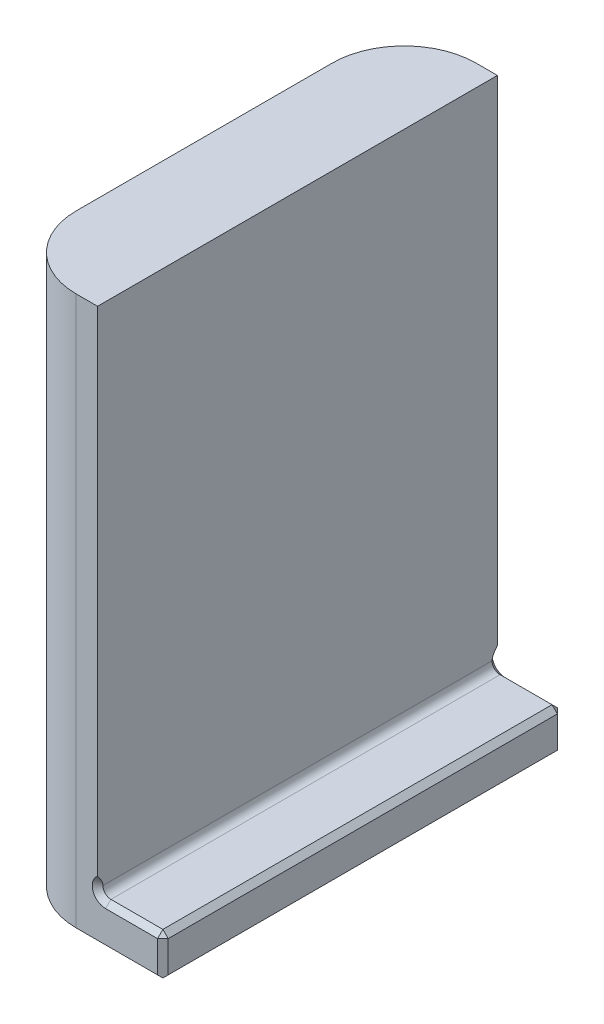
ISO-10303-21;
HEADER;
FILE_DESCRIPTION(('STEP AP214'),'2;1');
FILE_NAME('part.step','',(''),(''),'','','');
FILE_SCHEMA(('AUTOMOTIVE_DESIGN { 1 0 10303 214 1 1 1 1 }'));
ENDSEC;
DATA;
#1=APPLICATION_CONTEXT('core data for automotive mechanical design processes');
#2=APPLICATION_PROTOCOL_DEFINITION('international standard','automotive_design',2000,#1);
#3=PRODUCT_CONTEXT('',#1,'mechanical');
#4=PRODUCT('Part','Part','',(#3));
#5=PRODUCT_RELATED_PRODUCT_CATEGORY('part','',(#4));
#6=PRODUCT_DEFINITION_FORMATION('','',#4);
#7=PRODUCT_DEFINITION_CONTEXT('part definition',#1,'design');
#8=PRODUCT_DEFINITION('design','',#6,#7);
#9=PRODUCT_DEFINITION_SHAPE('','',#8);
#10=(LENGTH_UNIT() NAMED_UNIT(*) SI_UNIT(.MILLI.,.METRE.));
#11=(NAMED_UNIT(*) PLANE_ANGLE_UNIT() SI_UNIT($,.RADIAN.));
#12=(NAMED_UNIT(*) SI_UNIT($,.STERADIAN.) SOLID_ANGLE_UNIT());
#13=UNCERTAINTY_MEASURE_WITH_UNIT(LENGTH_MEASURE(1.E-05),#10,'distance_accuracy_value','');
#14=(GEOMETRIC_REPRESENTATION_CONTEXT(3) GLOBAL_UNCERTAINTY_ASSIGNED_CONTEXT((#13)) GLOBAL_UNIT_ASSIGNED_CONTEXT((#10,
#11,#12)) REPRESENTATION_CONTEXT('',''));
#15=CARTESIAN_POINT('',(0.,0.,0.));
#16=DIRECTION('',(0.,0.,1.));
#17=DIRECTION('',(1.,0.,0.));
#18=AXIS2_PLACEMENT_3D('',#15,#16,#17);
#19=CARTESIAN_POINT('',(4.445,0.,9.525));
#20=DIRECTION('',(0.,-1.,0.));
#21=DIRECTION('',(1.,0.,0.));
#22=AXIS2_PLACEMENT_3D('',#19,#20,#21);
#23=PLANE('',#22);
#24=DIRECTION('',(-1.,0.,0.));
#25=VECTOR('',#24,1.);
#26=CARTESIAN_POINT('',(4.445,0.,-9.525));
#27=LINE('',#26,#25);
#28=CARTESIAN_POINT('',(4.445,0.,-9.525));
#29=VERTEX_POINT('',#28);
#30=CARTESIAN_POINT('',(3.429,0.,-9.525));
#31=VERTEX_POINT('',#30);
#32=EDGE_CURVE('E187',#29,#31,#27,.T.);
#33=ORIENTED_EDGE('',*,*,#32,.T.);
#34=CARTESIAN_POINT('',(3.429,0.,-6.096));
#35=DIRECTION('',(0.,-1.,0.));
#36=DIRECTION('',(1.,0.,0.));
#37=AXIS2_PLACEMENT_3D('',#34,#35,#36);
#38=CIRCLE('',#37,3.429);
#39=CARTESIAN_POINT('',(0.,0.,-6.096));
#40=VERTEX_POINT('',#39);
#41=EDGE_CURVE('E208',#31,#40,#38,.F.);
#42=ORIENTED_EDGE('',*,*,#41,.T.);
#43=DIRECTION('',(0.,0.,-1.));
#44=VECTOR('',#43,1.);
#45=CARTESIAN_POINT('',(0.,0.,9.525));
#46=LINE('',#45,#44);
#47=CARTESIAN_POINT('',(0.,0.,6.096));
#48=VERTEX_POINT('',#47);
#49=EDGE_CURVE('E197',#48,#40,#46,.T.);
#50=ORIENTED_EDGE('',*,*,#49,.F.);
#51=CARTESIAN_POINT('',(3.429,0.,6.096));
#52=DIRECTION('',(0.,-1.,0.));
#53=DIRECTION('',(1.,0.,0.));
#54=AXIS2_PLACEMENT_3D('',#51,#52,#53);
#55=CIRCLE('',#54,3.429);
#56=CARTESIAN_POINT('',(3.429,0.,9.525));
#57=VERTEX_POINT('',#56);
#58=EDGE_CURVE('E185',#48,#57,#55,.F.);
#59=ORIENTED_EDGE('',*,*,#58,.T.);
#60=DIRECTION('',(-1.,0.,0.));
#61=VECTOR('',#60,1.);
#62=CARTESIAN_POINT('',(4.445,0.,9.525));
#63=LINE('',#62,#61);
#64=CARTESIAN_POINT('',(4.445,0.,9.525));
#65=VERTEX_POINT('',#64);
#66=EDGE_CURVE('E167',#65,#57,#63,.T.);
#67=ORIENTED_EDGE('',*,*,#66,.F.);
#68=DIRECTION('',(0.,0.,-1.));
#69=VECTOR('',#68,1.);
#70=CARTESIAN_POINT('',(4.445,0.,9.525));
#71=LINE('',#70,#69);
#72=EDGE_CURVE('E172',#65,#29,#71,.T.);
#73=ORIENTED_EDGE('',*,*,#72,.T.);
#74=EDGE_LOOP('',(#33,#42,#50,#59,#67,#73));
#75=FACE_BOUND('',#74,.T.);
#76=ADVANCED_FACE('F34',(#75),#23,.F.);
#77=CARTESIAN_POINT('',(0.,0.,9.525));
#78=DIRECTION('',(1.,0.,0.));
#79=DIRECTION('',(0.,1.,0.));
#80=AXIS2_PLACEMENT_3D('',#77,#78,#79);
#81=PLANE('',#80);
#82=DIRECTION('',(0.,-1.,0.));
#83=VECTOR('',#82,1.);
#84=CARTESIAN_POINT('',(0.,-26.924,-6.096));
#85=LINE('',#84,#83);
#86=CARTESIAN_POINT('',(0.,-26.162,-6.096));
#87=VERTEX_POINT('',#86);
#88=EDGE_CURVE('E202',#40,#87,#85,.T.);
#89=ORIENTED_EDGE('',*,*,#88,.T.);
#90=DIRECTION('',(0.,0.,1.));
#91=VECTOR('',#90,1.);
#92=CARTESIAN_POINT('',(0.,-26.162,9.525));
#93=LINE('',#92,#91);
#94=CARTESIAN_POINT('',(0.,-26.162,6.096));
#95=VERTEX_POINT('',#94);
#96=EDGE_CURVE('E230',#87,#95,#93,.T.);
#97=ORIENTED_EDGE('',*,*,#96,.T.);
#98=DIRECTION('',(0.,-1.,0.));
#99=VECTOR('',#98,1.);
#100=CARTESIAN_POINT('',(0.,0.,6.096));
#101=LINE('',#100,#99);
#102=EDGE_CURVE('E200',#95,#48,#101,.F.);
#103=ORIENTED_EDGE('',*,*,#102,.T.);
#104=ORIENTED_EDGE('',*,*,#49,.T.);
#105=EDGE_LOOP('',(#89,#97,#103,#104));
#106=FACE_BOUND('',#105,.T.);
#107=ADVANCED_FACE('F295',(#106),#81,.F.);
#108=CARTESIAN_POINT('',(0.,-26.924,9.525));
#109=DIRECTION('',(0.,1.,0.));
#110=DIRECTION('',(0.,0.,1.));
#111=AXIS2_PLACEMENT_3D('',#108,#109,#110);
#112=PLANE('',#111);
#113=DIRECTION('',(0.,0.,-1.));
#114=VECTOR('',#113,1.);
#115=CARTESIAN_POINT('',(0.762000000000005,-26.924,9.525));
#116=LINE('',#115,#114);
#117=CARTESIAN_POINT('',(0.762000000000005,-26.924,6.096));
#118=VERTEX_POINT('',#117);
#119=CARTESIAN_POINT('',(0.762000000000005,-26.924,-6.096));
#120=VERTEX_POINT('',#119);
#121=EDGE_CURVE('E222',#118,#120,#116,.T.);
#122=ORIENTED_EDGE('',*,*,#121,.T.);
#123=CARTESIAN_POINT('',(3.429,-26.924,-6.096));
#124=DIRECTION('',(0.,1.,0.));
#125=DIRECTION('',(0.,0.,1.));
#126=AXIS2_PLACEMENT_3D('',#123,#124,#125);
#127=CIRCLE('',#126,2.667);
#128=CARTESIAN_POINT('',(3.429,-26.924,-8.763));
#129=VERTEX_POINT('',#128);
#130=EDGE_CURVE('E224',#120,#129,#127,.F.);
#131=ORIENTED_EDGE('',*,*,#130,.T.);
#132=DIRECTION('',(1.,0.,0.));
#133=VECTOR('',#132,1.);
#134=CARTESIAN_POINT('',(7.5565,-26.924,-8.763));
#135=LINE('',#134,#133);
#136=CARTESIAN_POINT('',(6.7945,-26.924,-8.763));
#137=VERTEX_POINT('',#136);
#138=EDGE_CURVE('E217',#129,#137,#135,.T.);
#139=ORIENTED_EDGE('',*,*,#138,.T.);
#140=DIRECTION('',(0.,0.,1.));
#141=VECTOR('',#140,1.);
#142=CARTESIAN_POINT('',(6.7945,-26.924,9.525));
#143=LINE('',#142,#141);
#144=CARTESIAN_POINT('',(6.7945,-26.924,8.763));
#145=VERTEX_POINT('',#144);
#146=EDGE_CURVE('E214',#137,#145,#143,.T.);
#147=ORIENTED_EDGE('',*,*,#146,.T.);
#148=DIRECTION('',(-1.,0.,0.));
#149=VECTOR('',#148,1.);
#150=CARTESIAN_POINT('',(0.,-26.924,8.763));
#151=LINE('',#150,#149);
#152=CARTESIAN_POINT('',(3.429,-26.924,8.763));
#153=VERTEX_POINT('',#152);
#154=EDGE_CURVE('E212',#145,#153,#151,.T.);
#155=ORIENTED_EDGE('',*,*,#154,.T.);
#156=CARTESIAN_POINT('',(3.429,-26.924,6.096));
#157=DIRECTION('',(0.,1.,0.));
#158=DIRECTION('',(0.,0.,1.));
#159=AXIS2_PLACEMENT_3D('',#156,#157,#158);
#160=CIRCLE('',#159,2.667);
#161=EDGE_CURVE('E220',#153,#118,#160,.F.);
#162=ORIENTED_EDGE('',*,*,#161,.T.);
#163=EDGE_LOOP('',(#122,#131,#139,#147,#155,#162));
#164=FACE_BOUND('',#163,.T.);
#165=ADVANCED_FACE('F291',(#164),#112,.F.);
#166=CARTESIAN_POINT('',(7.5565,-26.924,9.525));
#167=DIRECTION('',(-1.,0.,0.));
#168=DIRECTION('',(0.,-1.,0.));
#169=AXIS2_PLACEMENT_3D('',#166,#167,#168);
#170=PLANE('',#169);
#171=DIRECTION('',(0.,0.,-1.));
#172=VECTOR('',#171,1.);
#173=CARTESIAN_POINT('',(7.5565,-26.162,9.525));
#174=LINE('',#173,#172);
#175=CARTESIAN_POINT('',(7.5565,-26.162,9.27100000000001));
#176=VERTEX_POINT('',#175);
#177=CARTESIAN_POINT('',(7.5565,-26.162,-9.27100000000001));
#178=VERTEX_POINT('',#177);
#179=EDGE_CURVE('E236',#176,#178,#174,.T.);
#180=ORIENTED_EDGE('',*,*,#179,.T.);
#181=DIRECTION('',(0.,1.,0.));
#182=VECTOR('',#181,1.);
#183=CARTESIAN_POINT('',(7.5565,-24.4094,-9.27100000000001));
#184=LINE('',#183,#182);
#185=CARTESIAN_POINT('',(7.5565,-24.6634,-9.27100000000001));
#186=VERTEX_POINT('',#185);
#187=EDGE_CURVE('E448',#178,#186,#184,.T.);
#188=ORIENTED_EDGE('',*,*,#187,.T.);
#189=DIRECTION('',(0.,0.,1.));
#190=VECTOR('',#189,1.);
#191=CARTESIAN_POINT('',(7.5565,-24.6634,9.525));
#192=LINE('',#191,#190);
#193=CARTESIAN_POINT('',(7.5565,-24.6634,9.27100000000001));
#194=VERTEX_POINT('',#193);
#195=EDGE_CURVE('E452',#186,#194,#192,.T.);
#196=ORIENTED_EDGE('',*,*,#195,.T.);
#197=DIRECTION('',(0.,-1.,0.));
#198=VECTOR('',#197,1.);
#199=CARTESIAN_POINT('',(7.5565,-26.924,9.27100000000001));
#200=LINE('',#199,#198);
#201=EDGE_CURVE('E450',#194,#176,#200,.T.);
#202=ORIENTED_EDGE('',*,*,#201,.T.);
#203=EDGE_LOOP('',(#180,#188,#196,#202));
#204=FACE_BOUND('',#203,.T.);
#205=ADVANCED_FACE('F288',(#204),#170,.F.);
#206=CARTESIAN_POINT('',(7.5565,-24.4094,9.525));
#207=DIRECTION('',(0.,-1.,0.));
#208=DIRECTION('',(0.,0.,-1.));
#209=AXIS2_PLACEMENT_3D('',#206,#207,#208);
#210=PLANE('',#209);
#211=DIRECTION('',(0.,0.,-1.));
#212=VECTOR('',#211,1.);
#213=CARTESIAN_POINT('',(7.30250000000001,-24.4094,9.525));
#214=LINE('',#213,#212);
#215=CARTESIAN_POINT('',(7.30250000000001,-24.4094,9.27100000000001));
#216=VERTEX_POINT('',#215);
#217=CARTESIAN_POINT('',(7.30250000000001,-24.4094,-9.27100000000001));
#218=VERTEX_POINT('',#217);
#219=EDGE_CURVE('E53',#216,#218,#214,.T.);
#220=ORIENTED_EDGE('',*,*,#219,.T.);
#221=DIRECTION('',(-1.,0.,0.));
#222=VECTOR('',#221,1.);
#223=CARTESIAN_POINT('',(4.826,-24.4094,-9.27100000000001));
#224=LINE('',#223,#222);
#225=CARTESIAN_POINT('',(4.826,-24.4094,-9.271));
#226=VERTEX_POINT('',#225);
#227=EDGE_CURVE('E45',#218,#226,#224,.T.);
#228=ORIENTED_EDGE('',*,*,#227,.T.);
#229=DIRECTION('',(0.,0.,-1.));
#230=VECTOR('',#229,1.);
#231=CARTESIAN_POINT('',(4.826,-24.4094,9.525));
#232=LINE('',#231,#230);
#233=CARTESIAN_POINT('',(4.826,-24.4094,9.27100000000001));
#234=VERTEX_POINT('',#233);
#235=EDGE_CURVE('E194',#234,#226,#232,.T.);
#236=ORIENTED_EDGE('',*,*,#235,.F.);
#237=DIRECTION('',(1.,0.,0.));
#238=VECTOR('',#237,1.);
#239=CARTESIAN_POINT('',(7.5565,-24.4094,9.27100000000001));
#240=LINE('',#239,#238);
#241=EDGE_CURVE('E58',#234,#216,#240,.T.);
#242=ORIENTED_EDGE('',*,*,#241,.T.);
#243=EDGE_LOOP('',(#220,#228,#236,#242));
#244=FACE_BOUND('',#243,.T.);
#245=ADVANCED_FACE('F284',(#244),#210,.F.);
#246=CARTESIAN_POINT('',(4.826,-24.0284,9.525));
#247=DIRECTION('',(0.,0.,-1.));
#248=DIRECTION('',(-1.,0.,0.));
#249=AXIS2_PLACEMENT_3D('',#246,#247,#248);
#250=CYLINDRICAL_SURFACE('',#249,0.381);
#251=DIRECTION('',(0.,0.,-1.));
#252=VECTOR('',#251,1.);
#253=CARTESIAN_POINT('',(4.445,-24.0284,9.525));
#254=LINE('',#253,#252);
#255=CARTESIAN_POINT('',(4.445,-24.0284,9.27100000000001));
#256=VERTEX_POINT('',#255);
#257=CARTESIAN_POINT('',(4.445,-24.0284,-9.271));
#258=VERTEX_POINT('',#257);
#259=EDGE_CURVE('E181',#256,#258,#254,.T.);
#260=ORIENTED_EDGE('',*,*,#259,.F.);
#261=CARTESIAN_POINT('',(4.826,-24.0284,9.27100000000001));
#262=DIRECTION('',(0.,0.,-1.));
#263=DIRECTION('',(-1.,0.,0.));
#264=AXIS2_PLACEMENT_3D('',#261,#262,#263);
#265=CIRCLE('',#264,0.381);
#266=EDGE_CURVE('E459',#256,#234,#265,.F.);
#267=ORIENTED_EDGE('',*,*,#266,.T.);
#268=ORIENTED_EDGE('',*,*,#235,.T.);
#269=CARTESIAN_POINT('',(4.826,-24.0284,-9.271));
#270=DIRECTION('',(0.,0.,-1.));
#271=DIRECTION('',(-1.,0.,0.));
#272=AXIS2_PLACEMENT_3D('',#269,#270,#271);
#273=CIRCLE('',#272,0.381);
#274=EDGE_CURVE('E460',#226,#258,#273,.T.);
#275=ORIENTED_EDGE('',*,*,#274,.T.);
#276=EDGE_LOOP('',(#260,#267,#268,#275));
#277=FACE_BOUND('',#276,.T.);
#278=ADVANCED_FACE('F278',(#277),#250,.F.);
#279=CARTESIAN_POINT('',(4.445,-24.0284,9.525));
#280=DIRECTION('',(-1.,0.,0.));
#281=DIRECTION('',(0.,0.,1.));
#282=AXIS2_PLACEMENT_3D('',#279,#280,#281);
#283=PLANE('',#282);
#284=DIRECTION('',(0.,1.,0.));
#285=VECTOR('',#284,1.);
#286=CARTESIAN_POINT('',(4.445,-24.0284,9.525));
#287=LINE('',#286,#285);
#288=CARTESIAN_POINT('',(4.445,-23.5204,9.525));
#289=VERTEX_POINT('',#288);
#290=EDGE_CURVE('E162',#289,#65,#287,.T.);
#291=ORIENTED_EDGE('',*,*,#290,.F.);
#292=CARTESIAN_POINT('',(4.445,-23.5204,9.525));
#293=CARTESIAN_POINT('',(4.445,-23.5392528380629,9.50993164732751));
#294=CARTESIAN_POINT('',(4.445,-23.5582437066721,9.49502838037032));
#295=CARTESIAN_POINT('',(4.445,-23.5966376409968,9.465692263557));
#296=CARTESIAN_POINT('',(4.445,-23.6160413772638,9.4512602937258));
#297=CARTESIAN_POINT('',(4.445,-23.656021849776,9.4225658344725));
#298=CARTESIAN_POINT('',(4.445,-23.676615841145,9.40832714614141));
#299=CARTESIAN_POINT('',(4.445,-23.7184683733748,9.38088629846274));
#300=CARTESIAN_POINT('',(4.445,-23.7397264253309,9.36768340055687));
#301=CARTESIAN_POINT('',(4.445,-23.7881488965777,9.33988690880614));
#302=CARTESIAN_POINT('',(4.445,-23.8155406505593,9.32567980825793));
#303=CARTESIAN_POINT('',(4.445,-23.8717075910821,9.30120402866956));
#304=CARTESIAN_POINT('',(4.445,-23.9004590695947,9.29088470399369));
#305=CARTESIAN_POINT('',(4.445,-23.9459500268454,9.27951535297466));
#306=CARTESIAN_POINT('',(4.445,-23.9621594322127,9.27638461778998));
#307=CARTESIAN_POINT('',(4.445,-23.9950320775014,9.27209807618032));
#308=CARTESIAN_POINT('',(4.445,-24.0116984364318,9.27096665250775));
#309=CARTESIAN_POINT('',(4.445,-24.0284,9.27100000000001));
#310=B_SPLINE_CURVE_WITH_KNOTS('',3,(#292,#293,#294,#295,#296,#297,#298,#299,#300,#301,#302,
#303,#304,#305,#306,#307,#308,#309),.UNSPECIFIED.,.F.,.F.,(4,2,2,2,2,2,2,2,4),(0.,
0.0724102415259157,0.144948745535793,0.220037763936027,0.295072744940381,0.387492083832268,
0.478662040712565,0.528072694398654,0.578081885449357),.UNSPECIFIED.);
#311=EDGE_CURVE('E267',#289,#256,#310,.T.);
#312=ORIENTED_EDGE('',*,*,#311,.T.);
#313=ORIENTED_EDGE('',*,*,#259,.T.);
#314=CARTESIAN_POINT('',(4.445,-24.0284,-9.271));
#315=CARTESIAN_POINT('',(4.445,-24.0166787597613,-9.27099160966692));
#316=CARTESIAN_POINT('',(4.445,-24.0049658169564,-9.27154124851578));
#317=CARTESIAN_POINT('',(4.445,-23.9816590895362,-9.27368325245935));
#318=CARTESIAN_POINT('',(4.445,-23.9700651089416,-9.27527346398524));
#319=CARTESIAN_POINT('',(4.445,-23.9359498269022,-9.28142552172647));
#320=CARTESIAN_POINT('',(4.445,-23.9136754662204,-9.28737419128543));
#321=CARTESIAN_POINT('',(4.445,-23.8679910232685,-9.30277250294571));
#322=CARTESIAN_POINT('',(4.445,-23.8446822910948,-9.31250718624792));
#323=CARTESIAN_POINT('',(4.445,-23.7991135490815,-9.33422024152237));
#324=CARTESIAN_POINT('',(4.445,-23.7768556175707,-9.34620284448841));
#325=CARTESIAN_POINT('',(4.445,-23.7329061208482,-9.37182423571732));
#326=CARTESIAN_POINT('',(4.445,-23.711227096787,-9.38548413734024));
#327=CARTESIAN_POINT('',(4.445,-23.6685493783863,-9.41383173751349));
#328=CARTESIAN_POINT('',(4.445,-23.6475509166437,-9.42851978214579));
#329=CARTESIAN_POINT('',(4.445,-23.6085967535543,-9.45677891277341));
#330=CARTESIAN_POINT('',(4.445,-23.5905815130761,-9.47026867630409));
#331=CARTESIAN_POINT('',(4.445,-23.5551414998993,-9.49746241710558));
#332=CARTESIAN_POINT('',(4.445,-23.5377119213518,-9.51116011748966));
#333=CARTESIAN_POINT('',(4.445,-23.5204,-9.52499999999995));
#334=B_SPLINE_CURVE_WITH_KNOTS('',3,(#314,#315,#316,#317,#318,#319,#320,#321,#322,#323,#324,
#325,#326,#327,#328,#329,#330,#331,#332,#333),.UNSPECIFIED.,.F.,.F.,(4,2,2,2,2,2,2,2,2,4),(0.,
0.0351366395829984,0.0702007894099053,0.139087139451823,0.214697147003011,0.290450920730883,
0.367281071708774,0.444137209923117,0.51164892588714,0.578144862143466),.UNSPECIFIED.);
#335=CARTESIAN_POINT('',(4.445,-23.5204,-9.525));
#336=VERTEX_POINT('',#335);
#337=EDGE_CURVE('E260',#258,#336,#334,.T.);
#338=ORIENTED_EDGE('',*,*,#337,.T.);
#339=DIRECTION('',(0.,1.,0.));
#340=VECTOR('',#339,1.);
#341=CARTESIAN_POINT('',(4.445,-24.0284,-9.525));
#342=LINE('',#341,#340);
#343=EDGE_CURVE('E177',#336,#29,#342,.T.);
#344=ORIENTED_EDGE('',*,*,#343,.T.);
#345=ORIENTED_EDGE('',*,*,#72,.F.);
#346=EDGE_LOOP('',(#291,#312,#313,#338,#344,#345));
#347=FACE_BOUND('',#346,.T.);
#348=ADVANCED_FACE('F175',(#347),#283,.F.);
#349=CARTESIAN_POINT('',(4.826,-24.0284,9.525));
#350=DIRECTION('',(0.,0.,-1.));
#351=DIRECTION('',(-1.,0.,0.));
#352=AXIS2_PLACEMENT_3D('',#349,#350,#351);
#353=PLANE('',#352);
#354=DIRECTION('',(-1.,0.,0.));
#355=VECTOR('',#354,1.);
#356=CARTESIAN_POINT('',(4.826,-24.6634,9.525));
#357=LINE('',#356,#355);
#358=CARTESIAN_POINT('',(7.30250000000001,-24.6634,9.525));
#359=VERTEX_POINT('',#358);
#360=CARTESIAN_POINT('',(4.826,-24.6634,9.525));
#361=VERTEX_POINT('',#360);
#362=EDGE_CURVE('E242',#359,#361,#357,.T.);
#363=ORIENTED_EDGE('',*,*,#362,.T.);
#364=CARTESIAN_POINT('',(4.826,-24.0284,9.525));
#365=DIRECTION('',(0.,0.,-1.));
#366=DIRECTION('',(-1.,0.,0.));
#367=AXIS2_PLACEMENT_3D('',#364,#365,#366);
#368=CIRCLE('',#367,0.634999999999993);
#369=EDGE_CURVE('E170',#361,#289,#368,.T.);
#370=ORIENTED_EDGE('',*,*,#369,.T.);
#371=ORIENTED_EDGE('',*,*,#290,.T.);
#372=ORIENTED_EDGE('',*,*,#66,.T.);
#373=DIRECTION('',(0.,-1.,0.));
#374=VECTOR('',#373,1.);
#375=CARTESIAN_POINT('',(3.429,-24.0284,9.525));
#376=LINE('',#375,#374);
#377=CARTESIAN_POINT('',(3.429,-26.162,9.525));
#378=VERTEX_POINT('',#377);
#379=EDGE_CURVE('E210',#57,#378,#376,.T.);
#380=ORIENTED_EDGE('',*,*,#379,.T.);
#381=DIRECTION('',(1.,0.,0.));
#382=VECTOR('',#381,1.);
#383=CARTESIAN_POINT('',(4.826,-26.162,9.525));
#384=LINE('',#383,#382);
#385=CARTESIAN_POINT('',(7.30250000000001,-26.162,9.525));
#386=VERTEX_POINT('',#385);
#387=EDGE_CURVE('E239',#378,#386,#384,.T.);
#388=ORIENTED_EDGE('',*,*,#387,.T.);
#389=DIRECTION('',(0.,1.,0.));
#390=VECTOR('',#389,1.);
#391=CARTESIAN_POINT('',(7.30250000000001,-24.0284,9.525));
#392=LINE('',#391,#390);
#393=EDGE_CURVE('E257',#386,#359,#392,.T.);
#394=ORIENTED_EDGE('',*,*,#393,.T.);
#395=EDGE_LOOP('',(#363,#370,#371,#372,#380,#388,#394));
#396=FACE_BOUND('',#395,.T.);
#397=ADVANCED_FACE('F164',(#396),#353,.F.);
#398=CARTESIAN_POINT('',(4.826,-24.0284,-9.525));
#399=DIRECTION('',(0.,0.,-1.));
#400=DIRECTION('',(-1.,0.,0.));
#401=AXIS2_PLACEMENT_3D('',#398,#399,#400);
#402=PLANE('',#401);
#403=ORIENTED_EDGE('',*,*,#343,.F.);
#404=CARTESIAN_POINT('',(4.826,-24.0284,-9.525));
#405=DIRECTION('',(0.,0.,-1.));
#406=DIRECTION('',(-1.,0.,0.));
#407=AXIS2_PLACEMENT_3D('',#404,#405,#406);
#408=CIRCLE('',#407,0.634999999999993);
#409=CARTESIAN_POINT('',(4.826,-24.6634,-9.525));
#410=VERTEX_POINT('',#409);
#411=EDGE_CURVE('E454',#336,#410,#408,.F.);
#412=ORIENTED_EDGE('',*,*,#411,.T.);
#413=DIRECTION('',(1.,0.,0.));
#414=VECTOR('',#413,1.);
#415=CARTESIAN_POINT('',(7.5565,-24.6634,-9.525));
#416=LINE('',#415,#414);
#417=CARTESIAN_POINT('',(7.30250000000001,-24.6634,-9.525));
#418=VERTEX_POINT('',#417);
#419=EDGE_CURVE('E415',#410,#418,#416,.T.);
#420=ORIENTED_EDGE('',*,*,#419,.T.);
#421=DIRECTION('',(0.,-1.,0.));
#422=VECTOR('',#421,1.);
#423=CARTESIAN_POINT('',(7.30250000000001,-26.162,-9.525));
#424=LINE('',#423,#422);
#425=CARTESIAN_POINT('',(7.30250000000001,-26.162,-9.525));
#426=VERTEX_POINT('',#425);
#427=EDGE_CURVE('E456',#418,#426,#424,.T.);
#428=ORIENTED_EDGE('',*,*,#427,.T.);
#429=DIRECTION('',(-1.,0.,0.));
#430=VECTOR('',#429,1.);
#431=CARTESIAN_POINT('',(3.429,-26.162,-9.525));
#432=LINE('',#431,#430);
#433=CARTESIAN_POINT('',(3.429,-26.162,-9.525));
#434=VERTEX_POINT('',#433);
#435=EDGE_CURVE('E234',#426,#434,#432,.T.);
#436=ORIENTED_EDGE('',*,*,#435,.T.);
#437=DIRECTION('',(0.,-1.,0.));
#438=VECTOR('',#437,1.);
#439=CARTESIAN_POINT('',(3.429,0.,-9.525));
#440=LINE('',#439,#438);
#441=EDGE_CURVE('E205',#434,#31,#440,.F.);
#442=ORIENTED_EDGE('',*,*,#441,.T.);
#443=ORIENTED_EDGE('',*,*,#32,.F.);
#444=EDGE_LOOP('',(#403,#412,#420,#428,#436,#442,#443));
#445=FACE_BOUND('',#444,.T.);
#446=ADVANCED_FACE('F279',(#445),#402,.T.);
#447=CARTESIAN_POINT('',(3.429,0.,-6.096));
#448=DIRECTION('',(0.,1.,0.));
#449=DIRECTION('',(-1.,0.,0.));
#450=AXIS2_PLACEMENT_3D('',#447,#448,#449);
#451=CYLINDRICAL_SURFACE('',#450,3.429);
#452=ORIENTED_EDGE('',*,*,#441,.F.);
#453=CARTESIAN_POINT('',(3.429,-26.162,-6.096));
#454=DIRECTION('',(0.,1.,0.));
#455=DIRECTION('',(-1.,0.,0.));
#456=AXIS2_PLACEMENT_3D('',#453,#454,#455);
#457=CIRCLE('',#456,3.429);
#458=EDGE_CURVE('E227',#434,#87,#457,.T.);
#459=ORIENTED_EDGE('',*,*,#458,.T.);
#460=ORIENTED_EDGE('',*,*,#88,.F.);
#461=ORIENTED_EDGE('',*,*,#41,.F.);
#462=EDGE_LOOP('',(#452,#459,#460,#461));
#463=FACE_BOUND('',#462,.T.);
#464=ADVANCED_FACE('F302',(#463),#451,.T.);
#465=CARTESIAN_POINT('',(3.429,-24.0284,6.096));
#466=DIRECTION('',(0.,-1.,0.));
#467=DIRECTION('',(1.,0.,0.));
#468=AXIS2_PLACEMENT_3D('',#465,#466,#467);
#469=CYLINDRICAL_SURFACE('',#468,3.429);
#470=ORIENTED_EDGE('',*,*,#102,.F.);
#471=CARTESIAN_POINT('',(3.429,-26.162,6.096));
#472=DIRECTION('',(0.,1.,0.));
#473=DIRECTION('',(0.,0.,1.));
#474=AXIS2_PLACEMENT_3D('',#471,#472,#473);
#475=CIRCLE('',#474,3.429);
#476=EDGE_CURVE('E232',#95,#378,#475,.T.);
#477=ORIENTED_EDGE('',*,*,#476,.T.);
#478=ORIENTED_EDGE('',*,*,#379,.F.);
#479=ORIENTED_EDGE('',*,*,#58,.F.);
#480=EDGE_LOOP('',(#470,#477,#478,#479));
#481=FACE_BOUND('',#480,.T.);
#482=ADVANCED_FACE('F305',(#481),#469,.T.);
#483=CARTESIAN_POINT('',(4.826,-26.162,9.525));
#484=DIRECTION('',(0.,0.707106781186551,-0.707106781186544));
#485=DIRECTION('',(1.,0.,0.));
#486=AXIS2_PLACEMENT_3D('',#483,#484,#485);
#487=PLANE('',#486);
#488=DIRECTION('',(0.577350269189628,0.577350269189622,0.577350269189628));
#489=VECTOR('',#488,1.);
#490=CARTESIAN_POINT('',(6.64633333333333,-27.0721666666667,8.61483333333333));
#491=LINE('',#490,#489);
#492=CARTESIAN_POINT('',(7.4295,-26.289,9.398));
#493=VERTEX_POINT('',#492);
#494=EDGE_CURVE('E252',#493,#145,#491,.F.);
#495=ORIENTED_EDGE('',*,*,#494,.F.);
#496=DIRECTION('',(-0.577350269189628,0.577350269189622,0.577350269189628));
#497=VECTOR('',#496,1.);
#498=CARTESIAN_POINT('',(6.477,-25.3365,10.3505));
#499=LINE('',#498,#497);
#500=EDGE_CURVE('E11',#493,#386,#499,.T.);
#501=ORIENTED_EDGE('',*,*,#500,.T.);
#502=ORIENTED_EDGE('',*,*,#387,.F.);
#503=DIRECTION('',(0.,0.707106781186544,0.707106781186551));
#504=VECTOR('',#503,1.);
#505=CARTESIAN_POINT('',(3.429,-26.924,8.763));
#506=LINE('',#505,#504);
#507=EDGE_CURVE('E190',#153,#378,#506,.T.);
#508=ORIENTED_EDGE('',*,*,#507,.F.);
#509=ORIENTED_EDGE('',*,*,#154,.F.);
#510=EDGE_LOOP('',(#495,#501,#502,#508,#509));
#511=FACE_BOUND('',#510,.T.);
#512=ADVANCED_FACE('F309',(#511),#487,.F.);
#513=CARTESIAN_POINT('',(3.429,-26.924,6.096));
#514=DIRECTION('',(0.,1.,0.));
#515=DIRECTION('',(0.,0.,1.));
#516=AXIS2_PLACEMENT_3D('',#513,#514,#515);
#517=CONICAL_SURFACE('',#516,2.667,0.785398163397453);
#518=ORIENTED_EDGE('',*,*,#507,.T.);
#519=ORIENTED_EDGE('',*,*,#476,.F.);
#520=DIRECTION('',(-0.707106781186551,0.707106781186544,0.));
#521=VECTOR('',#520,1.);
#522=CARTESIAN_POINT('',(0.762000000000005,-26.924,6.096));
#523=LINE('',#522,#521);
#524=EDGE_CURVE('E249',#118,#95,#523,.T.);
#525=ORIENTED_EDGE('',*,*,#524,.F.);
#526=ORIENTED_EDGE('',*,*,#161,.F.);
#527=EDGE_LOOP('',(#518,#519,#525,#526));
#528=FACE_BOUND('',#527,.T.);
#529=ADVANCED_FACE('F339',(#528),#517,.T.);
#530=CARTESIAN_POINT('',(7.5565,-26.162,9.525));
#531=DIRECTION('',(-0.707106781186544,0.707106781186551,0.));
#532=DIRECTION('',(0.,0.,-1.));
#533=AXIS2_PLACEMENT_3D('',#530,#531,#532);
#534=PLANE('',#533);
#535=DIRECTION('',(-0.577350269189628,-0.577350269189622,0.577350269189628));
#536=VECTOR('',#535,1.);
#537=CARTESIAN_POINT('',(1.20649999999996,-32.512,-3.17499999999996));
#538=LINE('',#537,#536);
#539=CARTESIAN_POINT('',(7.42950000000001,-26.289,-9.398));
#540=VERTEX_POINT('',#539);
#541=EDGE_CURVE('E247',#540,#137,#538,.T.);
#542=ORIENTED_EDGE('',*,*,#541,.F.);
#543=DIRECTION('',(-0.577350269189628,-0.577350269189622,-0.577350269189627));
#544=VECTOR('',#543,1.);
#545=CARTESIAN_POINT('',(13.8218333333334,-19.8966666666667,-3.00566666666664));
#546=LINE('',#545,#544);
#547=EDGE_CURVE('E442',#540,#178,#546,.F.);
#548=ORIENTED_EDGE('',*,*,#547,.T.);
#549=ORIENTED_EDGE('',*,*,#179,.F.);
#550=DIRECTION('',(-0.577350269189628,-0.577350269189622,0.577350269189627));
#551=VECTOR('',#550,1.);
#552=CARTESIAN_POINT('',(7.47183333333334,-26.2466666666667,9.35566666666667));
#553=LINE('',#552,#551);
#554=EDGE_CURVE('E444',#176,#493,#553,.T.);
#555=ORIENTED_EDGE('',*,*,#554,.T.);
#556=ORIENTED_EDGE('',*,*,#494,.T.);
#557=ORIENTED_EDGE('',*,*,#146,.F.);
#558=EDGE_LOOP('',(#542,#548,#549,#555,#556,#557));
#559=FACE_BOUND('',#558,.T.);
#560=ADVANCED_FACE('F332',(#559),#534,.F.);
#561=CARTESIAN_POINT('',(0.762000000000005,-26.924,9.525));
#562=DIRECTION('',(0.707106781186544,0.707106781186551,0.));
#563=DIRECTION('',(0.,0.,-1.));
#564=AXIS2_PLACEMENT_3D('',#561,#562,#563);
#565=PLANE('',#564);
#566=ORIENTED_EDGE('',*,*,#524,.T.);
#567=ORIENTED_EDGE('',*,*,#96,.F.);
#568=DIRECTION('',(-0.707106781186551,0.707106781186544,0.));
#569=VECTOR('',#568,1.);
#570=CARTESIAN_POINT('',(0.762000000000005,-26.924,-6.096));
#571=LINE('',#570,#569);
#572=EDGE_CURVE('E245',#120,#87,#571,.T.);
#573=ORIENTED_EDGE('',*,*,#572,.F.);
#574=ORIENTED_EDGE('',*,*,#121,.F.);
#575=EDGE_LOOP('',(#566,#567,#573,#574));
#576=FACE_BOUND('',#575,.T.);
#577=ADVANCED_FACE('F325',(#576),#565,.F.);
#578=CARTESIAN_POINT('',(0.,-26.924,-8.763));
#579=DIRECTION('',(0.,-0.707106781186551,-0.707106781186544));
#580=DIRECTION('',(-1.,0.,0.));
#581=AXIS2_PLACEMENT_3D('',#578,#579,#580);
#582=PLANE('',#581);
#583=ORIENTED_EDGE('',*,*,#435,.F.);
#584=DIRECTION('',(0.577350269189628,-0.577350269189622,0.577350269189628));
#585=VECTOR('',#584,1.);
#586=CARTESIAN_POINT('',(5.37633333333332,-24.2358333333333,-11.4511666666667));
#587=LINE('',#586,#585);
#588=EDGE_CURVE('E446',#426,#540,#587,.T.);
#589=ORIENTED_EDGE('',*,*,#588,.T.);
#590=ORIENTED_EDGE('',*,*,#541,.T.);
#591=ORIENTED_EDGE('',*,*,#138,.F.);
#592=DIRECTION('',(0.,-0.707106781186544,0.707106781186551));
#593=VECTOR('',#592,1.);
#594=CARTESIAN_POINT('',(3.429,-26.162,-9.525));
#595=LINE('',#594,#593);
#596=EDGE_CURVE('E243',#434,#129,#595,.T.);
#597=ORIENTED_EDGE('',*,*,#596,.F.);
#598=EDGE_LOOP('',(#583,#589,#590,#591,#597));
#599=FACE_BOUND('',#598,.T.);
#600=ADVANCED_FACE('F318',(#599),#582,.T.);
#601=CARTESIAN_POINT('',(3.429,-26.924,-6.096));
#602=DIRECTION('',(0.,1.,0.));
#603=DIRECTION('',(-1.,0.,0.));
#604=AXIS2_PLACEMENT_3D('',#601,#602,#603);
#605=CONICAL_SURFACE('',#604,2.667,0.785398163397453);
#606=ORIENTED_EDGE('',*,*,#572,.T.);
#607=ORIENTED_EDGE('',*,*,#458,.F.);
#608=ORIENTED_EDGE('',*,*,#596,.T.);
#609=ORIENTED_EDGE('',*,*,#130,.F.);
#610=EDGE_LOOP('',(#606,#607,#608,#609));
#611=FACE_BOUND('',#610,.T.);
#612=ADVANCED_FACE('F312',(#611),#605,.T.);
#613=CARTESIAN_POINT('',(4.826,-24.0284,-9.271));
#614=DIRECTION('',(0.,0.,-1.));
#615=DIRECTION('',(-1.,0.,0.));
#616=AXIS2_PLACEMENT_3D('',#613,#614,#615);
#617=CONICAL_SURFACE('',#616,0.381,0.785398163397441);
#618=ORIENTED_EDGE('',*,*,#337,.F.);
#619=ORIENTED_EDGE('',*,*,#274,.F.);
#620=DIRECTION('',(0.,0.707106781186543,0.707106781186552));
#621=VECTOR('',#620,1.);
#622=CARTESIAN_POINT('',(4.826,-24.6634,-9.525));
#623=LINE('',#622,#621);
#624=EDGE_CURVE('E40',#410,#226,#623,.T.);
#625=ORIENTED_EDGE('',*,*,#624,.F.);
#626=ORIENTED_EDGE('',*,*,#411,.F.);
#627=EDGE_LOOP('',(#618,#619,#625,#626));
#628=FACE_BOUND('',#627,.T.);
#629=ADVANCED_FACE('F37',(#628),#617,.F.);
#630=CARTESIAN_POINT('',(7.5565,-24.4094,-9.27100000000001));
#631=DIRECTION('',(0.,0.707106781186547,-0.707106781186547));
#632=DIRECTION('',(1.,0.,0.));
#633=AXIS2_PLACEMENT_3D('',#630,#631,#632);
#634=PLANE('',#633);
#635=ORIENTED_EDGE('',*,*,#624,.T.);
#636=ORIENTED_EDGE('',*,*,#227,.F.);
#637=DIRECTION('',(0.,0.707106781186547,0.707106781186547));
#638=VECTOR('',#637,1.);
#639=CARTESIAN_POINT('',(7.30250000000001,-24.5364,-9.398));
#640=LINE('',#639,#638);
#641=EDGE_CURVE('E418',#418,#218,#640,.T.);
#642=ORIENTED_EDGE('',*,*,#641,.F.);
#643=ORIENTED_EDGE('',*,*,#419,.F.);
#644=EDGE_LOOP('',(#635,#636,#642,#643));
#645=FACE_BOUND('',#644,.T.);
#646=ADVANCED_FACE('F400',(#645),#634,.T.);
#647=CARTESIAN_POINT('',(7.5565,-26.924,-9.27100000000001));
#648=DIRECTION('',(0.707106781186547,0.,-0.707106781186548));
#649=DIRECTION('',(0.,-1.,0.));
#650=AXIS2_PLACEMENT_3D('',#647,#648,#649);
#651=PLANE('',#650);
#652=ORIENTED_EDGE('',*,*,#588,.F.);
#653=ORIENTED_EDGE('',*,*,#427,.F.);
#654=DIRECTION('',(-0.707106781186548,0.,-0.707106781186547));
#655=VECTOR('',#654,1.);
#656=CARTESIAN_POINT('',(7.5565,-24.6634,-9.27100000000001));
#657=LINE('',#656,#655);
#658=EDGE_CURVE('E419',#186,#418,#657,.T.);
#659=ORIENTED_EDGE('',*,*,#658,.F.);
#660=ORIENTED_EDGE('',*,*,#187,.F.);
#661=ORIENTED_EDGE('',*,*,#547,.F.);
#662=EDGE_LOOP('',(#652,#653,#659,#660,#661));
#663=FACE_BOUND('',#662,.T.);
#664=ADVANCED_FACE('F394',(#663),#651,.T.);
#665=CARTESIAN_POINT('',(7.5565,-24.6634,-9.27100000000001));
#666=DIRECTION('',(0.577350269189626,0.577350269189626,-0.577350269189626));
#667=DIRECTION('',(-0.707106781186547,0.,-0.707106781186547));
#668=AXIS2_PLACEMENT_3D('',#665,#666,#667);
#669=PLANE('',#668);
#670=ORIENTED_EDGE('',*,*,#658,.T.);
#671=ORIENTED_EDGE('',*,*,#641,.T.);
#672=DIRECTION('',(-0.707106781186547,0.707106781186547,0.));
#673=VECTOR('',#672,1.);
#674=CARTESIAN_POINT('',(7.5565,-24.6634,-9.27100000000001));
#675=LINE('',#674,#673);
#676=EDGE_CURVE('E423',#186,#218,#675,.T.);
#677=ORIENTED_EDGE('',*,*,#676,.F.);
#678=EDGE_LOOP('',(#670,#671,#677));
#679=FACE_BOUND('',#678,.T.);
#680=ADVANCED_FACE('F387',(#679),#669,.T.);
#681=CARTESIAN_POINT('',(7.30250000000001,-24.4094,9.525));
#682=DIRECTION('',(-0.707106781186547,-0.707106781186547,0.));
#683=DIRECTION('',(0.,0.,-1.));
#684=AXIS2_PLACEMENT_3D('',#681,#682,#683);
#685=PLANE('',#684);
#686=ORIENTED_EDGE('',*,*,#676,.T.);
#687=ORIENTED_EDGE('',*,*,#219,.F.);
#688=DIRECTION('',(0.707106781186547,-0.707106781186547,0.));
#689=VECTOR('',#688,1.);
#690=CARTESIAN_POINT('',(7.4295,-24.5364,9.27100000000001));
#691=LINE('',#690,#689);
#692=EDGE_CURVE('E427',#194,#216,#691,.F.);
#693=ORIENTED_EDGE('',*,*,#692,.F.);
#694=ORIENTED_EDGE('',*,*,#195,.F.);
#695=EDGE_LOOP('',(#686,#687,#693,#694));
#696=FACE_BOUND('',#695,.T.);
#697=ADVANCED_FACE('F380',(#696),#685,.F.);
#698=CARTESIAN_POINT('',(7.30250000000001,-24.0284,9.525));
#699=DIRECTION('',(-0.707106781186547,0.,-0.707106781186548));
#700=DIRECTION('',(0.,1.,0.));
#701=AXIS2_PLACEMENT_3D('',#698,#699,#700);
#702=PLANE('',#701);
#703=ORIENTED_EDGE('',*,*,#554,.F.);
#704=ORIENTED_EDGE('',*,*,#201,.F.);
#705=DIRECTION('',(-0.707106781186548,0.,0.707106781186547));
#706=VECTOR('',#705,1.);
#707=CARTESIAN_POINT('',(7.30250000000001,-24.6634,9.525));
#708=LINE('',#707,#706);
#709=EDGE_CURVE('E430',#359,#194,#708,.F.);
#710=ORIENTED_EDGE('',*,*,#709,.F.);
#711=ORIENTED_EDGE('',*,*,#393,.F.);
#712=ORIENTED_EDGE('',*,*,#500,.F.);
#713=EDGE_LOOP('',(#703,#704,#710,#711,#712));
#714=FACE_BOUND('',#713,.T.);
#715=ADVANCED_FACE('F373',(#714),#702,.F.);
#716=CARTESIAN_POINT('',(7.30250000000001,-24.6634,9.525));
#717=DIRECTION('',(0.577350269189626,0.577350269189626,0.577350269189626));
#718=DIRECTION('',(0.707106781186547,0.,-0.707106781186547));
#719=AXIS2_PLACEMENT_3D('',#716,#717,#718);
#720=PLANE('',#719);
#721=ORIENTED_EDGE('',*,*,#709,.T.);
#722=ORIENTED_EDGE('',*,*,#692,.T.);
#723=DIRECTION('',(0.,0.707106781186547,-0.707106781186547));
#724=VECTOR('',#723,1.);
#725=CARTESIAN_POINT('',(7.30250000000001,-24.6634,9.525));
#726=LINE('',#725,#724);
#727=EDGE_CURVE('E433',#359,#216,#726,.T.);
#728=ORIENTED_EDGE('',*,*,#727,.F.);
#729=EDGE_LOOP('',(#721,#722,#728));
#730=FACE_BOUND('',#729,.T.);
#731=ADVANCED_FACE('F366',(#730),#720,.T.);
#732=CARTESIAN_POINT('',(4.826,-24.6634,9.525));
#733=DIRECTION('',(0.,-0.707106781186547,-0.707106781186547));
#734=DIRECTION('',(-1.,0.,0.));
#735=AXIS2_PLACEMENT_3D('',#732,#733,#734);
#736=PLANE('',#735);
#737=ORIENTED_EDGE('',*,*,#727,.T.);
#738=ORIENTED_EDGE('',*,*,#241,.F.);
#739=DIRECTION('',(0.,0.707106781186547,-0.707106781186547));
#740=VECTOR('',#739,1.);
#741=CARTESIAN_POINT('',(4.826,-24.6634,9.525));
#742=LINE('',#741,#740);
#743=EDGE_CURVE('E436',#361,#234,#742,.T.);
#744=ORIENTED_EDGE('',*,*,#743,.F.);
#745=ORIENTED_EDGE('',*,*,#362,.F.);
#746=EDGE_LOOP('',(#737,#738,#744,#745));
#747=FACE_BOUND('',#746,.T.);
#748=ADVANCED_FACE('F359',(#747),#736,.F.);
#749=CARTESIAN_POINT('',(4.826,-24.0284,9.525));
#750=DIRECTION('',(0.,0.,1.));
#751=DIRECTION('',(1.,0.,0.));
#752=AXIS2_PLACEMENT_3D('',#749,#750,#751);
#753=CONICAL_SURFACE('',#752,0.634999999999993,0.785398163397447);
#754=ORIENTED_EDGE('',*,*,#743,.T.);
#755=ORIENTED_EDGE('',*,*,#266,.F.);
#756=ORIENTED_EDGE('',*,*,#311,.F.);
#757=ORIENTED_EDGE('',*,*,#369,.F.);
#758=EDGE_LOOP('',(#754,#755,#756,#757));
#759=FACE_BOUND('',#758,.T.);
#760=ADVANCED_FACE('F352',(#759),#753,.F.);
#761=CLOSED_SHELL('',(#76,#107,#165,#205,#245,#278,#348,#397,#446,#464,#482,#512,#529,#560,#577,
#600,#612,#629,#646,#664,#680,#697,#715,#731,#748,#760));
#762=MANIFOLD_SOLID_BREP('B2',#761);
#763=ADVANCED_BREP_SHAPE_REPRESENTATION('',(#18,#762),#14);
#764=SHAPE_DEFINITION_REPRESENTATION(#9,#763);
ENDSEC;
END-ISO-10303-21;
